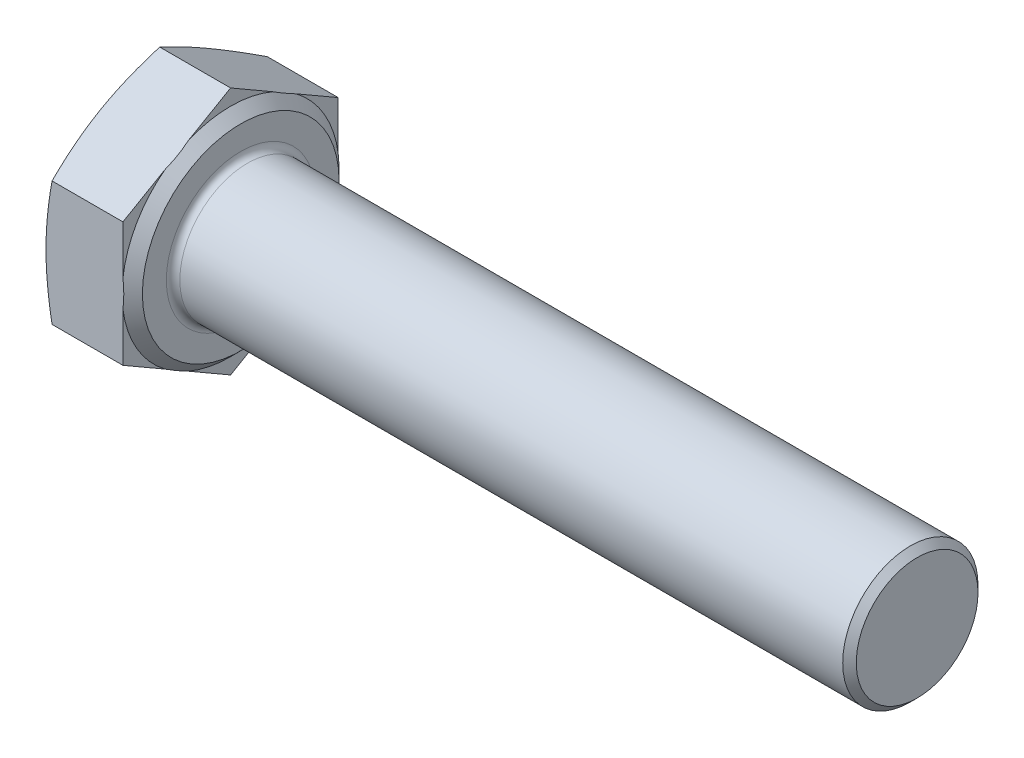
from build123d import *

# Parameters (mm, degrees)
BASEHEAD_DEPTH = 5.15
SKETCH5_R      = 4
BASEBODY_DEPTH = 40
CHAMFER1_SIZE  = 0.4
HEADFILLET_R   = 0.4


with BuildPart() as part:
    # Sketch2 → BaseHead (new body)
    with BuildSketch(Plane(origin=(0, 0, 0), x_dir=(0, 0, -1), z_dir=(1, 0, 0))):
        Polygon((0, -7.349668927), (6.365, -3.674834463), (6.365, 3.674834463), (0, 7.349668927), (-6.365, 3.674834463), (-6.365, -3.674834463), align=None)
    extrude(amount=BASEHEAD_DEPTH)

    # Sketch3 → BearingFace (revolve, cut)
    with BuildSketch(Plane.XY, mode=Mode.PRIVATE) as bearingface_sk:
        Polygon((5.15, 7.349668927), (5.15, 5.815), (4.55, 6.415), (4.55, 7.349668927), align=None)
    revolve(bearingface_sk.sketch.rotate(Axis((-0.957090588, 0, 0), (1, 0, 0)), 90), axis=Axis((-0.957090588, 0, 0), (1, 0, 0)), mode=Mode.SUBTRACT)

    # Sketch4 → HeadChamfer (revolve, cut)
    with BuildSketch(Plane.XY):
        Polygon((0, 7.349668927), (0.35839018, 7.349668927), (0, 6.365), align=None)
    revolve(axis=Axis((-0.493528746, 0, 0), (1, 0, 0)), mode=Mode.SUBTRACT)

    # Sketch5 → BaseBody (add)
    with BuildSketch(Plane(origin=(5.15, 0, 0), x_dir=(0, 0, -1), z_dir=(1, 0, 0))):
        with Locations(Location((0, 0, 0), (0, 0, 180))):
            Circle(SKETCH5_R)
    extrude(amount=BASEBODY_DEPTH)

    # Chamfer1
    chamfer1_edges = [part.edges().sort_by_distance(p)[0] for p in [
        (45.15, 0, -4),
    ]]
    chamfer(chamfer1_edges, length=CHAMFER1_SIZE)

    # HeadFillet
    headfillet_edges = [part.edges().sort_by_distance(p)[0] for p in [
        (5.15, 0, -4),
    ]]
    fillet(headfillet_edges, radius=HEADFILLET_R)


solid = part.part
